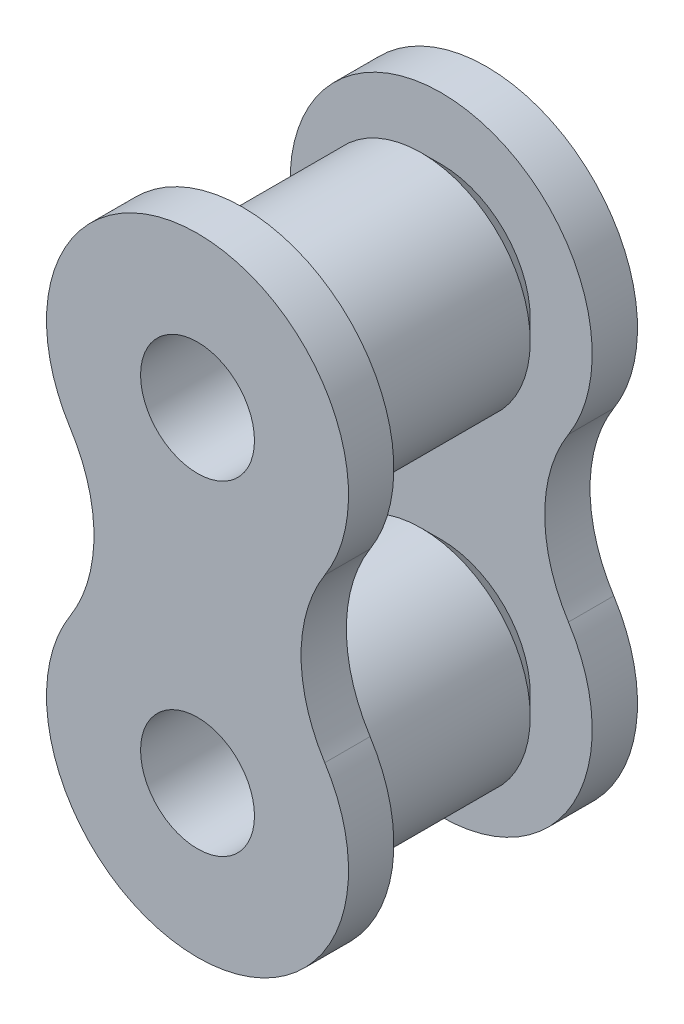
ISO-10303-21;
HEADER;
FILE_DESCRIPTION(('STEP AP214'),'2;1');
FILE_NAME('part.step','',(''),(''),'','','');
FILE_SCHEMA(('AUTOMOTIVE_DESIGN { 1 0 10303 214 1 1 1 1 }'));
ENDSEC;
DATA;
#1=APPLICATION_CONTEXT('core data for automotive mechanical design processes');
#2=APPLICATION_PROTOCOL_DEFINITION('international standard','automotive_design',2000,#1);
#3=PRODUCT_CONTEXT('',#1,'mechanical');
#4=PRODUCT('Part','Part','',(#3));
#5=PRODUCT_RELATED_PRODUCT_CATEGORY('part','',(#4));
#6=PRODUCT_DEFINITION_FORMATION('','',#4);
#7=PRODUCT_DEFINITION_CONTEXT('part definition',#1,'design');
#8=PRODUCT_DEFINITION('design','',#6,#7);
#9=PRODUCT_DEFINITION_SHAPE('','',#8);
#10=(LENGTH_UNIT() NAMED_UNIT(*) SI_UNIT(.MILLI.,.METRE.));
#11=(NAMED_UNIT(*) PLANE_ANGLE_UNIT() SI_UNIT($,.RADIAN.));
#12=(NAMED_UNIT(*) SI_UNIT($,.STERADIAN.) SOLID_ANGLE_UNIT());
#13=UNCERTAINTY_MEASURE_WITH_UNIT(LENGTH_MEASURE(1.E-05),#10,'distance_accuracy_value','');
#14=(GEOMETRIC_REPRESENTATION_CONTEXT(3) GLOBAL_UNCERTAINTY_ASSIGNED_CONTEXT((#13)) GLOBAL_UNIT_ASSIGNED_CONTEXT((#10,
#11,#12)) REPRESENTATION_CONTEXT('',''));
#15=CARTESIAN_POINT('',(0.,0.,0.));
#16=DIRECTION('',(0.,0.,1.));
#17=DIRECTION('',(1.,0.,0.));
#18=AXIS2_PLACEMENT_3D('',#15,#16,#17);
#19=CARTESIAN_POINT('',(0.,0.,-3.875));
#20=DIRECTION('',(0.,0.,1.));
#21=DIRECTION('',(1.,0.,0.));
#22=AXIS2_PLACEMENT_3D('',#19,#20,#21);
#23=PLANE('',#22);
#24=CARTESIAN_POINT('',(0.,0.,-3.875));
#25=DIRECTION('',(0.,0.,1.));
#26=DIRECTION('',(0.,1.,0.));
#27=AXIS2_PLACEMENT_3D('',#24,#25,#26);
#28=CIRCLE('',#27,3.48);
#29=CARTESIAN_POINT('',(0.,3.48,-3.875));
#30=VERTEX_POINT('',#29);
#31=EDGE_CURVE('E175',#30,#30,#28,.T.);
#32=ORIENTED_EDGE('',*,*,#31,.F.);
#33=EDGE_LOOP('',(#32));
#34=FACE_BOUND('',#33,.T.);
#35=CARTESIAN_POINT('',(-9.94572772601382,6.35,-3.875));
#36=DIRECTION('',(0.,0.,-1.));
#37=DIRECTION('',(0.,1.,0.));
#38=AXIS2_PLACEMENT_3D('',#35,#36,#37);
#39=CIRCLE('',#38,5.9);
#40=CARTESIAN_POINT('',(-4.97286386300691,9.525,-3.875));
#41=VERTEX_POINT('',#40);
#42=CARTESIAN_POINT('',(-4.97286386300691,3.175,-3.875));
#43=VERTEX_POINT('',#42);
#44=EDGE_CURVE('E39',#41,#43,#39,.T.);
#45=ORIENTED_EDGE('',*,*,#44,.T.);
#46=CARTESIAN_POINT('',(0.,0.,-3.875));
#47=DIRECTION('',(0.,0.,-1.));
#48=DIRECTION('',(0.,1.,0.));
#49=AXIS2_PLACEMENT_3D('',#46,#47,#48);
#50=CIRCLE('',#49,5.9);
#51=CARTESIAN_POINT('',(4.97286386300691,3.175,-3.875));
#52=VERTEX_POINT('',#51);
#53=EDGE_CURVE('E205',#52,#43,#50,.T.);
#54=ORIENTED_EDGE('',*,*,#53,.F.);
#55=CARTESIAN_POINT('',(9.94572772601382,6.35,-3.875));
#56=DIRECTION('',(0.,0.,-1.));
#57=DIRECTION('',(0.,1.,0.));
#58=AXIS2_PLACEMENT_3D('',#55,#56,#57);
#59=CIRCLE('',#58,5.9);
#60=CARTESIAN_POINT('',(4.97286386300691,9.525,-3.875));
#61=VERTEX_POINT('',#60);
#62=EDGE_CURVE('E186',#52,#61,#59,.T.);
#63=ORIENTED_EDGE('',*,*,#62,.T.);
#64=CARTESIAN_POINT('',(0.,12.7,-3.875));
#65=DIRECTION('',(0.,0.,-1.));
#66=DIRECTION('',(0.,1.,0.));
#67=AXIS2_PLACEMENT_3D('',#64,#65,#66);
#68=CIRCLE('',#67,5.9);
#69=EDGE_CURVE('E194',#41,#61,#68,.T.);
#70=ORIENTED_EDGE('',*,*,#69,.F.);
#71=EDGE_LOOP('',(#45,#54,#63,#70));
#72=FACE_BOUND('',#71,.T.);
#73=CARTESIAN_POINT('',(0.,12.7,-3.875));
#74=DIRECTION('',(0.,0.,1.));
#75=DIRECTION('',(0.,1.,0.));
#76=AXIS2_PLACEMENT_3D('',#73,#74,#75);
#77=CIRCLE('',#76,3.48);
#78=CARTESIAN_POINT('',(0.,16.18,-3.875));
#79=VERTEX_POINT('',#78);
#80=EDGE_CURVE('E163',#79,#79,#77,.T.);
#81=ORIENTED_EDGE('',*,*,#80,.F.);
#82=EDGE_LOOP('',(#81));
#83=FACE_BOUND('',#82,.T.);
#84=ADVANCED_FACE('F16',(#34,#72,#83),#23,.T.);
#85=CARTESIAN_POINT('',(0.,0.,-5.645));
#86=DIRECTION('',(0.,0.,-1.));
#87=DIRECTION('',(-1.,0.,0.));
#88=AXIS2_PLACEMENT_3D('',#85,#86,#87);
#89=PLANE('',#88);
#90=CARTESIAN_POINT('',(0.,12.7,-5.645));
#91=DIRECTION('',(0.,0.,-1.));
#92=DIRECTION('',(-1.,0.,0.));
#93=AXIS2_PLACEMENT_3D('',#90,#91,#92);
#94=CIRCLE('',#93,2.225);
#95=CARTESIAN_POINT('',(-2.225,12.7,-5.645));
#96=VERTEX_POINT('',#95);
#97=EDGE_CURVE('E217',#96,#96,#94,.T.);
#98=ORIENTED_EDGE('',*,*,#97,.F.);
#99=EDGE_LOOP('',(#98));
#100=FACE_BOUND('',#99,.T.);
#101=CARTESIAN_POINT('',(0.,0.,-5.645));
#102=DIRECTION('',(0.,0.,-1.));
#103=DIRECTION('',(-1.,0.,0.));
#104=AXIS2_PLACEMENT_3D('',#101,#102,#103);
#105=CIRCLE('',#104,2.225);
#106=CARTESIAN_POINT('',(-2.225,0.,-5.645));
#107=VERTEX_POINT('',#106);
#108=EDGE_CURVE('E216',#107,#107,#105,.T.);
#109=ORIENTED_EDGE('',*,*,#108,.F.);
#110=EDGE_LOOP('',(#109));
#111=FACE_BOUND('',#110,.T.);
#112=CARTESIAN_POINT('',(-9.94572772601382,6.35,-5.645));
#113=DIRECTION('',(0.,0.,1.));
#114=DIRECTION('',(0.,1.,0.));
#115=AXIS2_PLACEMENT_3D('',#112,#113,#114);
#116=CIRCLE('',#115,5.9);
#117=CARTESIAN_POINT('',(-4.97286386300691,3.175,-5.645));
#118=VERTEX_POINT('',#117);
#119=CARTESIAN_POINT('',(-4.97286386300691,9.525,-5.645));
#120=VERTEX_POINT('',#119);
#121=EDGE_CURVE('E179',#118,#120,#116,.T.);
#122=ORIENTED_EDGE('',*,*,#121,.T.);
#123=CARTESIAN_POINT('',(0.,12.7,-5.645));
#124=DIRECTION('',(0.,0.,1.));
#125=DIRECTION('',(0.,1.,0.));
#126=AXIS2_PLACEMENT_3D('',#123,#124,#125);
#127=CIRCLE('',#126,5.9);
#128=CARTESIAN_POINT('',(4.97286386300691,9.525,-5.645));
#129=VERTEX_POINT('',#128);
#130=EDGE_CURVE('E190',#129,#120,#127,.T.);
#131=ORIENTED_EDGE('',*,*,#130,.F.);
#132=CARTESIAN_POINT('',(9.94572772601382,6.35,-5.645));
#133=DIRECTION('',(0.,0.,1.));
#134=DIRECTION('',(0.,1.,0.));
#135=AXIS2_PLACEMENT_3D('',#132,#133,#134);
#136=CIRCLE('',#135,5.9);
#137=CARTESIAN_POINT('',(4.97286386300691,3.175,-5.645));
#138=VERTEX_POINT('',#137);
#139=EDGE_CURVE('E51',#129,#138,#136,.T.);
#140=ORIENTED_EDGE('',*,*,#139,.T.);
#141=CARTESIAN_POINT('',(0.,0.,-5.645));
#142=DIRECTION('',(0.,0.,1.));
#143=DIRECTION('',(0.,1.,0.));
#144=AXIS2_PLACEMENT_3D('',#141,#142,#143);
#145=CIRCLE('',#144,5.9);
#146=EDGE_CURVE('E201',#118,#138,#145,.T.);
#147=ORIENTED_EDGE('',*,*,#146,.F.);
#148=EDGE_LOOP('',(#122,#131,#140,#147));
#149=FACE_BOUND('',#148,.T.);
#150=ADVANCED_FACE('F267',(#100,#111,#149),#89,.T.);
#151=CARTESIAN_POINT('',(0.,0.,-5.645));
#152=DIRECTION('',(0.,0.,1.));
#153=DIRECTION('',(0.,1.,0.));
#154=AXIS2_PLACEMENT_3D('',#151,#152,#153);
#155=CYLINDRICAL_SURFACE('',#154,5.9);
#156=DIRECTION('',(0.,0.,1.));
#157=VECTOR('',#156,1.);
#158=CARTESIAN_POINT('',(-4.97286386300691,3.175,-5.645));
#159=LINE('',#158,#157);
#160=EDGE_CURVE('E26',#118,#43,#159,.T.);
#161=ORIENTED_EDGE('',*,*,#160,.F.);
#162=ORIENTED_EDGE('',*,*,#146,.T.);
#163=DIRECTION('',(0.,0.,1.));
#164=VECTOR('',#163,1.);
#165=CARTESIAN_POINT('',(4.97286386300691,3.175,-5.645));
#166=LINE('',#165,#164);
#167=EDGE_CURVE('E209',#52,#138,#166,.F.);
#168=ORIENTED_EDGE('',*,*,#167,.F.);
#169=ORIENTED_EDGE('',*,*,#53,.T.);
#170=EDGE_LOOP('',(#161,#162,#168,#169));
#171=FACE_BOUND('',#170,.T.);
#172=ADVANCED_FACE('F18',(#171),#155,.T.);
#173=CARTESIAN_POINT('',(0.,12.7,-5.645));
#174=DIRECTION('',(0.,0.,1.));
#175=DIRECTION('',(0.,1.,0.));
#176=AXIS2_PLACEMENT_3D('',#173,#174,#175);
#177=CYLINDRICAL_SURFACE('',#176,5.9);
#178=ORIENTED_EDGE('',*,*,#130,.T.);
#179=DIRECTION('',(0.,0.,1.));
#180=VECTOR('',#179,1.);
#181=CARTESIAN_POINT('',(-4.97286386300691,9.525,-5.645));
#182=LINE('',#181,#180);
#183=EDGE_CURVE('E198',#120,#41,#182,.T.);
#184=ORIENTED_EDGE('',*,*,#183,.T.);
#185=ORIENTED_EDGE('',*,*,#69,.T.);
#186=DIRECTION('',(0.,0.,1.));
#187=VECTOR('',#186,1.);
#188=CARTESIAN_POINT('',(4.97286386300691,9.525,-5.645));
#189=LINE('',#188,#187);
#190=EDGE_CURVE('E11',#61,#129,#189,.F.);
#191=ORIENTED_EDGE('',*,*,#190,.T.);
#192=EDGE_LOOP('',(#178,#184,#185,#191));
#193=FACE_BOUND('',#192,.T.);
#194=ADVANCED_FACE('F277',(#193),#177,.T.);
#195=CARTESIAN_POINT('',(9.94572772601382,6.35,-5.645));
#196=DIRECTION('',(0.,0.,1.));
#197=DIRECTION('',(0.,1.,0.));
#198=AXIS2_PLACEMENT_3D('',#195,#196,#197);
#199=CYLINDRICAL_SURFACE('',#198,5.9);
#200=ORIENTED_EDGE('',*,*,#167,.T.);
#201=ORIENTED_EDGE('',*,*,#139,.F.);
#202=ORIENTED_EDGE('',*,*,#190,.F.);
#203=ORIENTED_EDGE('',*,*,#62,.F.);
#204=EDGE_LOOP('',(#200,#201,#202,#203));
#205=FACE_BOUND('',#204,.T.);
#206=ADVANCED_FACE('F280',(#205),#199,.F.);
#207=CARTESIAN_POINT('',(-9.94572772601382,6.35,-5.645));
#208=DIRECTION('',(0.,0.,1.));
#209=DIRECTION('',(0.,1.,0.));
#210=AXIS2_PLACEMENT_3D('',#207,#208,#209);
#211=CYLINDRICAL_SURFACE('',#210,5.9);
#212=ORIENTED_EDGE('',*,*,#160,.T.);
#213=ORIENTED_EDGE('',*,*,#44,.F.);
#214=ORIENTED_EDGE('',*,*,#183,.F.);
#215=ORIENTED_EDGE('',*,*,#121,.F.);
#216=EDGE_LOOP('',(#212,#213,#214,#215));
#217=FACE_BOUND('',#216,.T.);
#218=ADVANCED_FACE('F284',(#217),#211,.F.);
#219=CARTESIAN_POINT('',(0.,0.,-3.1));
#220=DIRECTION('',(0.,0.,1.));
#221=DIRECTION('',(0.,1.,0.));
#222=AXIS2_PLACEMENT_3D('',#219,#220,#221);
#223=CYLINDRICAL_SURFACE('',#222,4.255);
#224=CARTESIAN_POINT('',(0.,0.,3.1));
#225=DIRECTION('',(0.,0.,1.));
#226=DIRECTION('',(1.,0.,0.));
#227=AXIS2_PLACEMENT_3D('',#224,#225,#226);
#228=CIRCLE('',#227,4.255);
#229=CARTESIAN_POINT('',(4.255,0.,3.1));
#230=VERTEX_POINT('',#229);
#231=EDGE_CURVE('E167',#230,#230,#228,.T.);
#232=ORIENTED_EDGE('',*,*,#231,.F.);
#233=EDGE_LOOP('',(#232));
#234=FACE_BOUND('',#233,.T.);
#235=CARTESIAN_POINT('',(0.,0.,-3.1));
#236=DIRECTION('',(0.,0.,-1.));
#237=DIRECTION('',(-1.,0.,0.));
#238=AXIS2_PLACEMENT_3D('',#235,#236,#237);
#239=CIRCLE('',#238,4.255);
#240=CARTESIAN_POINT('',(-4.255,0.,-3.1));
#241=VERTEX_POINT('',#240);
#242=EDGE_CURVE('E171',#241,#241,#239,.T.);
#243=ORIENTED_EDGE('',*,*,#242,.F.);
#244=EDGE_LOOP('',(#243));
#245=FACE_BOUND('',#244,.T.);
#246=ADVANCED_FACE('F287',(#234,#245),#223,.T.);
#247=CARTESIAN_POINT('',(0.,0.,-3.1));
#248=DIRECTION('',(0.,0.,1.));
#249=DIRECTION('',(1.,0.,0.));
#250=AXIS2_PLACEMENT_3D('',#247,#248,#249);
#251=CONICAL_SURFACE('',#250,4.255,0.785398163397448);
#252=ORIENTED_EDGE('',*,*,#31,.T.);
#253=EDGE_LOOP('',(#252));
#254=FACE_BOUND('',#253,.T.);
#255=ORIENTED_EDGE('',*,*,#242,.T.);
#256=EDGE_LOOP('',(#255));
#257=FACE_BOUND('',#256,.T.);
#258=ADVANCED_FACE('F290',(#254,#257),#251,.T.);
#259=CARTESIAN_POINT('',(0.,0.,3.1));
#260=DIRECTION('',(0.,0.,-1.));
#261=DIRECTION('',(-1.,0.,0.));
#262=AXIS2_PLACEMENT_3D('',#259,#260,#261);
#263=CONICAL_SURFACE('',#262,4.255,0.785398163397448);
#264=CARTESIAN_POINT('',(0.,0.,3.875));
#265=DIRECTION('',(0.,0.,-1.));
#266=DIRECTION('',(-1.,0.,0.));
#267=AXIS2_PLACEMENT_3D('',#264,#265,#266);
#268=CIRCLE('',#267,3.48);
#269=CARTESIAN_POINT('',(-3.48,0.,3.875));
#270=VERTEX_POINT('',#269);
#271=EDGE_CURVE('E151',#270,#270,#268,.T.);
#272=ORIENTED_EDGE('',*,*,#271,.T.);
#273=EDGE_LOOP('',(#272));
#274=FACE_BOUND('',#273,.T.);
#275=ORIENTED_EDGE('',*,*,#231,.T.);
#276=EDGE_LOOP('',(#275));
#277=FACE_BOUND('',#276,.T.);
#278=ADVANCED_FACE('F294',(#274,#277),#263,.T.);
#279=CARTESIAN_POINT('',(0.,12.7,-3.1));
#280=DIRECTION('',(0.,0.,1.));
#281=DIRECTION('',(0.,1.,0.));
#282=AXIS2_PLACEMENT_3D('',#279,#280,#281);
#283=CYLINDRICAL_SURFACE('',#282,4.255);
#284=CARTESIAN_POINT('',(0.,12.7,3.1));
#285=DIRECTION('',(0.,0.,1.));
#286=DIRECTION('',(1.,0.,0.));
#287=AXIS2_PLACEMENT_3D('',#284,#285,#286);
#288=CIRCLE('',#287,4.255);
#289=CARTESIAN_POINT('',(4.255,12.7,3.1));
#290=VERTEX_POINT('',#289);
#291=EDGE_CURVE('E155',#290,#290,#288,.T.);
#292=ORIENTED_EDGE('',*,*,#291,.F.);
#293=EDGE_LOOP('',(#292));
#294=FACE_BOUND('',#293,.T.);
#295=CARTESIAN_POINT('',(0.,12.7,-3.1));
#296=DIRECTION('',(0.,0.,-1.));
#297=DIRECTION('',(-1.,0.,0.));
#298=AXIS2_PLACEMENT_3D('',#295,#296,#297);
#299=CIRCLE('',#298,4.255);
#300=CARTESIAN_POINT('',(-4.255,12.7,-3.1));
#301=VERTEX_POINT('',#300);
#302=EDGE_CURVE('E159',#301,#301,#299,.T.);
#303=ORIENTED_EDGE('',*,*,#302,.F.);
#304=EDGE_LOOP('',(#303));
#305=FACE_BOUND('',#304,.T.);
#306=ADVANCED_FACE('F298',(#294,#305),#283,.T.);
#307=CARTESIAN_POINT('',(0.,12.7,-3.1));
#308=DIRECTION('',(0.,0.,1.));
#309=DIRECTION('',(1.,0.,0.));
#310=AXIS2_PLACEMENT_3D('',#307,#308,#309);
#311=CONICAL_SURFACE('',#310,4.255,0.785398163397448);
#312=ORIENTED_EDGE('',*,*,#80,.T.);
#313=EDGE_LOOP('',(#312));
#314=FACE_BOUND('',#313,.T.);
#315=ORIENTED_EDGE('',*,*,#302,.T.);
#316=EDGE_LOOP('',(#315));
#317=FACE_BOUND('',#316,.T.);
#318=ADVANCED_FACE('F302',(#314,#317),#311,.T.);
#319=CARTESIAN_POINT('',(0.,12.7,3.1));
#320=DIRECTION('',(0.,0.,-1.));
#321=DIRECTION('',(-1.,0.,0.));
#322=AXIS2_PLACEMENT_3D('',#319,#320,#321);
#323=CONICAL_SURFACE('',#322,4.255,0.785398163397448);
#324=CARTESIAN_POINT('',(0.,12.7,3.875));
#325=DIRECTION('',(0.,0.,-1.));
#326=DIRECTION('',(-1.,0.,0.));
#327=AXIS2_PLACEMENT_3D('',#324,#325,#326);
#328=CIRCLE('',#327,3.48);
#329=CARTESIAN_POINT('',(-3.48,12.7,3.875));
#330=VERTEX_POINT('',#329);
#331=EDGE_CURVE('E147',#330,#330,#328,.T.);
#332=ORIENTED_EDGE('',*,*,#331,.T.);
#333=EDGE_LOOP('',(#332));
#334=FACE_BOUND('',#333,.T.);
#335=ORIENTED_EDGE('',*,*,#291,.T.);
#336=EDGE_LOOP('',(#335));
#337=FACE_BOUND('',#336,.T.);
#338=ADVANCED_FACE('F306',(#334,#337),#323,.T.);
#339=CARTESIAN_POINT('',(0.,0.,3.875));
#340=DIRECTION('',(0.,0.,-1.));
#341=DIRECTION('',(-1.,0.,0.));
#342=AXIS2_PLACEMENT_3D('',#339,#340,#341);
#343=PLANE('',#342);
#344=ORIENTED_EDGE('',*,*,#331,.F.);
#345=EDGE_LOOP('',(#344));
#346=FACE_BOUND('',#345,.T.);
#347=CARTESIAN_POINT('',(-9.94572772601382,6.35,3.875));
#348=DIRECTION('',(0.,0.,1.));
#349=DIRECTION('',(0.,1.,0.));
#350=AXIS2_PLACEMENT_3D('',#347,#348,#349);
#351=CIRCLE('',#350,5.9);
#352=CARTESIAN_POINT('',(-4.97286386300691,3.175,3.875));
#353=VERTEX_POINT('',#352);
#354=CARTESIAN_POINT('',(-4.97286386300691,9.525,3.875));
#355=VERTEX_POINT('',#354);
#356=EDGE_CURVE('E110',#353,#355,#351,.T.);
#357=ORIENTED_EDGE('',*,*,#356,.T.);
#358=CARTESIAN_POINT('',(0.,12.7,3.875));
#359=DIRECTION('',(0.,0.,1.));
#360=DIRECTION('',(0.,1.,0.));
#361=AXIS2_PLACEMENT_3D('',#358,#359,#360);
#362=CIRCLE('',#361,5.9);
#363=CARTESIAN_POINT('',(4.97286386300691,9.525,3.875));
#364=VERTEX_POINT('',#363);
#365=EDGE_CURVE('E240',#364,#355,#362,.T.);
#366=ORIENTED_EDGE('',*,*,#365,.F.);
#367=CARTESIAN_POINT('',(9.94572772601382,6.35,3.875));
#368=DIRECTION('',(0.,0.,1.));
#369=DIRECTION('',(0.,1.,0.));
#370=AXIS2_PLACEMENT_3D('',#367,#368,#369);
#371=CIRCLE('',#370,5.9);
#372=CARTESIAN_POINT('',(4.97286386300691,3.175,3.875));
#373=VERTEX_POINT('',#372);
#374=EDGE_CURVE('E128',#364,#373,#371,.T.);
#375=ORIENTED_EDGE('',*,*,#374,.T.);
#376=CARTESIAN_POINT('',(0.,0.,3.875));
#377=DIRECTION('',(0.,0.,1.));
#378=DIRECTION('',(0.,1.,0.));
#379=AXIS2_PLACEMENT_3D('',#376,#377,#378);
#380=CIRCLE('',#379,5.9);
#381=EDGE_CURVE('E133',#353,#373,#380,.T.);
#382=ORIENTED_EDGE('',*,*,#381,.F.);
#383=EDGE_LOOP('',(#357,#366,#375,#382));
#384=FACE_BOUND('',#383,.T.);
#385=ORIENTED_EDGE('',*,*,#271,.F.);
#386=EDGE_LOOP('',(#385));
#387=FACE_BOUND('',#386,.T.);
#388=ADVANCED_FACE('F252',(#346,#384,#387),#343,.T.);
#389=CARTESIAN_POINT('',(0.,0.,5.645));
#390=DIRECTION('',(0.,0.,1.));
#391=DIRECTION('',(1.,0.,0.));
#392=AXIS2_PLACEMENT_3D('',#389,#390,#391);
#393=PLANE('',#392);
#394=CARTESIAN_POINT('',(0.,12.7,5.645));
#395=DIRECTION('',(0.,0.,1.));
#396=DIRECTION('',(1.,0.,0.));
#397=AXIS2_PLACEMENT_3D('',#394,#395,#396);
#398=CIRCLE('',#397,2.225);
#399=CARTESIAN_POINT('',(2.225,12.7,5.645));
#400=VERTEX_POINT('',#399);
#401=EDGE_CURVE('E20',#400,#400,#398,.T.);
#402=ORIENTED_EDGE('',*,*,#401,.F.);
#403=EDGE_LOOP('',(#402));
#404=FACE_BOUND('',#403,.T.);
#405=CARTESIAN_POINT('',(0.,0.,5.645));
#406=DIRECTION('',(0.,0.,1.));
#407=DIRECTION('',(1.,0.,0.));
#408=AXIS2_PLACEMENT_3D('',#405,#406,#407);
#409=CIRCLE('',#408,2.225);
#410=CARTESIAN_POINT('',(2.225,0.,5.645));
#411=VERTEX_POINT('',#410);
#412=EDGE_CURVE('E213',#411,#411,#409,.T.);
#413=ORIENTED_EDGE('',*,*,#412,.F.);
#414=EDGE_LOOP('',(#413));
#415=FACE_BOUND('',#414,.T.);
#416=CARTESIAN_POINT('',(-9.94572772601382,6.35,5.645));
#417=DIRECTION('',(0.,0.,-1.));
#418=DIRECTION('',(0.,1.,0.));
#419=AXIS2_PLACEMENT_3D('',#416,#417,#418);
#420=CIRCLE('',#419,5.9);
#421=CARTESIAN_POINT('',(-4.97286386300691,9.525,5.645));
#422=VERTEX_POINT('',#421);
#423=CARTESIAN_POINT('',(-4.97286386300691,3.175,5.645));
#424=VERTEX_POINT('',#423);
#425=EDGE_CURVE('E107',#422,#424,#420,.T.);
#426=ORIENTED_EDGE('',*,*,#425,.T.);
#427=CARTESIAN_POINT('',(0.,0.,5.645));
#428=DIRECTION('',(0.,0.,-1.));
#429=DIRECTION('',(0.,1.,0.));
#430=AXIS2_PLACEMENT_3D('',#427,#428,#429);
#431=CIRCLE('',#430,5.9);
#432=CARTESIAN_POINT('',(4.97286386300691,3.175,5.645));
#433=VERTEX_POINT('',#432);
#434=EDGE_CURVE('E124',#433,#424,#431,.T.);
#435=ORIENTED_EDGE('',*,*,#434,.F.);
#436=CARTESIAN_POINT('',(9.94572772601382,6.35,5.645));
#437=DIRECTION('',(0.,0.,-1.));
#438=DIRECTION('',(0.,1.,0.));
#439=AXIS2_PLACEMENT_3D('',#436,#437,#438);
#440=CIRCLE('',#439,5.9);
#441=CARTESIAN_POINT('',(4.97286386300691,9.525,5.645));
#442=VERTEX_POINT('',#441);
#443=EDGE_CURVE('E238',#433,#442,#440,.T.);
#444=ORIENTED_EDGE('',*,*,#443,.T.);
#445=CARTESIAN_POINT('',(0.,12.7,5.645));
#446=DIRECTION('',(0.,0.,-1.));
#447=DIRECTION('',(0.,1.,0.));
#448=AXIS2_PLACEMENT_3D('',#445,#446,#447);
#449=CIRCLE('',#448,5.9);
#450=EDGE_CURVE('E126',#422,#442,#449,.T.);
#451=ORIENTED_EDGE('',*,*,#450,.F.);
#452=EDGE_LOOP('',(#426,#435,#444,#451));
#453=FACE_BOUND('',#452,.T.);
#454=ADVANCED_FACE('F122',(#404,#415,#453),#393,.T.);
#455=CARTESIAN_POINT('',(0.,0.,3.875));
#456=DIRECTION('',(0.,0.,1.));
#457=DIRECTION('',(0.,1.,0.));
#458=AXIS2_PLACEMENT_3D('',#455,#456,#457);
#459=CYLINDRICAL_SURFACE('',#458,5.9);
#460=DIRECTION('',(0.,0.,1.));
#461=VECTOR('',#460,1.);
#462=CARTESIAN_POINT('',(-4.97286386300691,3.175,3.875));
#463=LINE('',#462,#461);
#464=EDGE_CURVE('E104',#353,#424,#463,.T.);
#465=ORIENTED_EDGE('',*,*,#464,.F.);
#466=ORIENTED_EDGE('',*,*,#381,.T.);
#467=DIRECTION('',(0.,0.,1.));
#468=VECTOR('',#467,1.);
#469=CARTESIAN_POINT('',(4.97286386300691,3.175,3.875));
#470=LINE('',#469,#468);
#471=EDGE_CURVE('E117',#433,#373,#470,.F.);
#472=ORIENTED_EDGE('',*,*,#471,.F.);
#473=ORIENTED_EDGE('',*,*,#434,.T.);
#474=EDGE_LOOP('',(#465,#466,#472,#473));
#475=FACE_BOUND('',#474,.T.);
#476=ADVANCED_FACE('F131',(#475),#459,.T.);
#477=CARTESIAN_POINT('',(0.,12.7,3.875));
#478=DIRECTION('',(0.,0.,1.));
#479=DIRECTION('',(0.,1.,0.));
#480=AXIS2_PLACEMENT_3D('',#477,#478,#479);
#481=CYLINDRICAL_SURFACE('',#480,5.9);
#482=ORIENTED_EDGE('',*,*,#365,.T.);
#483=DIRECTION('',(0.,0.,1.));
#484=VECTOR('',#483,1.);
#485=CARTESIAN_POINT('',(-4.97286386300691,9.525,3.875));
#486=LINE('',#485,#484);
#487=EDGE_CURVE('E140',#355,#422,#486,.T.);
#488=ORIENTED_EDGE('',*,*,#487,.T.);
#489=ORIENTED_EDGE('',*,*,#450,.T.);
#490=DIRECTION('',(0.,0.,1.));
#491=VECTOR('',#490,1.);
#492=CARTESIAN_POINT('',(4.97286386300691,9.525,3.875));
#493=LINE('',#492,#491);
#494=EDGE_CURVE('E116',#442,#364,#493,.F.);
#495=ORIENTED_EDGE('',*,*,#494,.T.);
#496=EDGE_LOOP('',(#482,#488,#489,#495));
#497=FACE_BOUND('',#496,.T.);
#498=ADVANCED_FACE('F249',(#497),#481,.T.);
#499=CARTESIAN_POINT('',(9.94572772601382,6.35,3.875));
#500=DIRECTION('',(0.,0.,1.));
#501=DIRECTION('',(0.,1.,0.));
#502=AXIS2_PLACEMENT_3D('',#499,#500,#501);
#503=CYLINDRICAL_SURFACE('',#502,5.9);
#504=ORIENTED_EDGE('',*,*,#471,.T.);
#505=ORIENTED_EDGE('',*,*,#374,.F.);
#506=ORIENTED_EDGE('',*,*,#494,.F.);
#507=ORIENTED_EDGE('',*,*,#443,.F.);
#508=EDGE_LOOP('',(#504,#505,#506,#507));
#509=FACE_BOUND('',#508,.T.);
#510=ADVANCED_FACE('F255',(#509),#503,.F.);
#511=CARTESIAN_POINT('',(-9.94572772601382,6.35,3.875));
#512=DIRECTION('',(0.,0.,1.));
#513=DIRECTION('',(0.,1.,0.));
#514=AXIS2_PLACEMENT_3D('',#511,#512,#513);
#515=CYLINDRICAL_SURFACE('',#514,5.9);
#516=ORIENTED_EDGE('',*,*,#464,.T.);
#517=ORIENTED_EDGE('',*,*,#425,.F.);
#518=ORIENTED_EDGE('',*,*,#487,.F.);
#519=ORIENTED_EDGE('',*,*,#356,.F.);
#520=EDGE_LOOP('',(#516,#517,#518,#519));
#521=FACE_BOUND('',#520,.T.);
#522=ADVANCED_FACE('F106',(#521),#515,.F.);
#523=CARTESIAN_POINT('',(0.,0.,-8.3));
#524=DIRECTION('',(0.,0.,1.));
#525=DIRECTION('',(0.,1.,0.));
#526=AXIS2_PLACEMENT_3D('',#523,#524,#525);
#527=CYLINDRICAL_SURFACE('',#526,2.225);
#528=ORIENTED_EDGE('',*,*,#108,.T.);
#529=EDGE_LOOP('',(#528));
#530=FACE_BOUND('',#529,.T.);
#531=ORIENTED_EDGE('',*,*,#412,.T.);
#532=EDGE_LOOP('',(#531));
#533=FACE_BOUND('',#532,.T.);
#534=ADVANCED_FACE('F263',(#530,#533),#527,.F.);
#535=CARTESIAN_POINT('',(0.,12.7,-8.3));
#536=DIRECTION('',(0.,0.,1.));
#537=DIRECTION('',(0.,1.,0.));
#538=AXIS2_PLACEMENT_3D('',#535,#536,#537);
#539=CYLINDRICAL_SURFACE('',#538,2.225);
#540=ORIENTED_EDGE('',*,*,#97,.T.);
#541=EDGE_LOOP('',(#540));
#542=FACE_BOUND('',#541,.T.);
#543=ORIENTED_EDGE('',*,*,#401,.T.);
#544=EDGE_LOOP('',(#543));
#545=FACE_BOUND('',#544,.T.);
#546=ADVANCED_FACE('F367',(#542,#545),#539,.F.);
#547=CLOSED_SHELL('',(#84,#150,#172,#194,#206,#218,#246,#258,#278,#306,#318,#338,#388,#454,#476,
#498,#510,#522,#534,#546));
#548=MANIFOLD_SOLID_BREP('B1',#547);
#549=ADVANCED_BREP_SHAPE_REPRESENTATION('',(#18,#548),#14);
#550=SHAPE_DEFINITION_REPRESENTATION(#9,#549);
ENDSEC;
END-ISO-10303-21;
